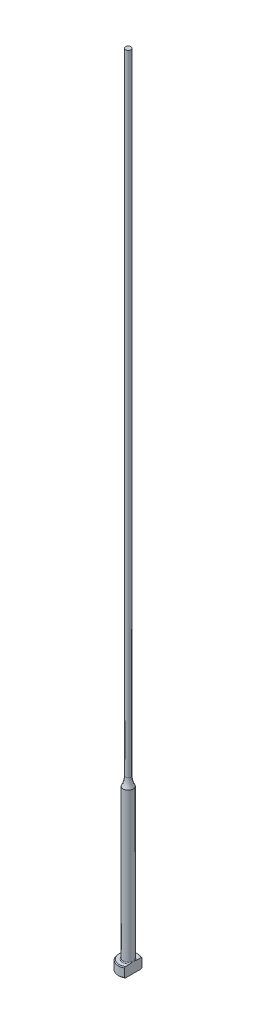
ISO-10303-21;
HEADER;
FILE_DESCRIPTION(('STEP AP214'),'2;1');
FILE_NAME('part.step','',(''),(''),'','','');
FILE_SCHEMA(('AUTOMOTIVE_DESIGN { 1 0 10303 214 1 1 1 1 }'));
ENDSEC;
DATA;
#1=APPLICATION_CONTEXT('core data for automotive mechanical design processes');
#2=APPLICATION_PROTOCOL_DEFINITION('international standard','automotive_design',2000,#1);
#3=PRODUCT_CONTEXT('',#1,'mechanical');
#4=PRODUCT('Part','Part','',(#3));
#5=PRODUCT_RELATED_PRODUCT_CATEGORY('part','',(#4));
#6=PRODUCT_DEFINITION_FORMATION('','',#4);
#7=PRODUCT_DEFINITION_CONTEXT('part definition',#1,'design');
#8=PRODUCT_DEFINITION('design','',#6,#7);
#9=PRODUCT_DEFINITION_SHAPE('','',#8);
#10=(LENGTH_UNIT() NAMED_UNIT(*) SI_UNIT(.MILLI.,.METRE.));
#11=(NAMED_UNIT(*) PLANE_ANGLE_UNIT() SI_UNIT($,.RADIAN.));
#12=(NAMED_UNIT(*) SI_UNIT($,.STERADIAN.) SOLID_ANGLE_UNIT());
#13=UNCERTAINTY_MEASURE_WITH_UNIT(LENGTH_MEASURE(1.E-05),#10,'distance_accuracy_value','');
#14=(GEOMETRIC_REPRESENTATION_CONTEXT(3) GLOBAL_UNCERTAINTY_ASSIGNED_CONTEXT((#13)) GLOBAL_UNIT_ASSIGNED_CONTEXT((#10,
#11,#12)) REPRESENTATION_CONTEXT('',''));
#15=CARTESIAN_POINT('',(0.,0.,0.));
#16=DIRECTION('',(0.,0.,1.));
#17=DIRECTION('',(1.,0.,0.));
#18=AXIS2_PLACEMENT_3D('',#15,#16,#17);
#19=CARTESIAN_POINT('',(-3.17499999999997,3.175,0.));
#20=DIRECTION('',(0.,1.,0.));
#21=DIRECTION('',(0.,0.,1.));
#22=AXIS2_PLACEMENT_3D('',#19,#20,#21);
#23=PLANE('',#22);
#24=CARTESIAN_POINT('',(0.,3.175,0.));
#25=DIRECTION('',(0.,1.,0.));
#26=DIRECTION('',(0.,0.,1.));
#27=AXIS2_PLACEMENT_3D('',#24,#25,#26);
#28=CIRCLE('',#27,2.92099999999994);
#29=CARTESIAN_POINT('',(1.58749999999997,3.175,-2.45195529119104));
#30=VERTEX_POINT('',#29);
#31=CARTESIAN_POINT('',(1.58749999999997,3.175,2.45195529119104));
#32=VERTEX_POINT('',#31);
#33=EDGE_CURVE('E105',#30,#32,#28,.T.);
#34=ORIENTED_EDGE('',*,*,#33,.T.);
#35=DIRECTION('',(0.,0.,1.));
#36=VECTOR('',#35,1.);
#37=CARTESIAN_POINT('',(1.58749999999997,3.17499999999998,2.74963065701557));
#38=LINE('',#37,#36);
#39=CARTESIAN_POINT('',(1.58749999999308,3.175,0.933255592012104));
#40=VERTEX_POINT('',#39);
#41=EDGE_CURVE('E126',#40,#32,#38,.T.);
#42=ORIENTED_EDGE('',*,*,#41,.F.);
#43=CARTESIAN_POINT('',(0.,3.175,0.));
#44=DIRECTION('',(0.,1.,0.));
#45=DIRECTION('',(0.,0.,1.));
#46=AXIS2_PLACEMENT_3D('',#43,#44,#45);
#47=CIRCLE('',#46,1.84149999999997);
#48=CARTESIAN_POINT('',(1.58749999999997,3.17500000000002,-0.933255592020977));
#49=VERTEX_POINT('',#48);
#50=EDGE_CURVE('E11',#40,#49,#47,.F.);
#51=ORIENTED_EDGE('',*,*,#50,.T.);
#52=EDGE_CURVE('E52',#30,#49,#38,.T.);
#53=ORIENTED_EDGE('',*,*,#52,.F.);
#54=EDGE_LOOP('',(#34,#42,#51,#53));
#55=FACE_BOUND('',#54,.T.);
#56=ADVANCED_FACE('F32',(#55),#23,.T.);
#57=CARTESIAN_POINT('',(0.,259.958771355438,0.));
#58=DIRECTION('',(0.,1.,0.));
#59=DIRECTION('',(0.,0.,1.));
#60=AXIS2_PLACEMENT_3D('',#57,#58,#59);
#61=CYLINDRICAL_SURFACE('',#60,3.17499999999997);
#62=CARTESIAN_POINT('',(0.,2.92100000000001,0.));
#63=DIRECTION('',(0.,1.,0.));
#64=DIRECTION('',(0.,0.,1.));
#65=AXIS2_PLACEMENT_3D('',#62,#63,#64);
#66=CIRCLE('',#65,3.17499999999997);
#67=CARTESIAN_POINT('',(1.58749999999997,2.92100000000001,2.74963065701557));
#68=VERTEX_POINT('',#67);
#69=CARTESIAN_POINT('',(1.58749999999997,2.92100000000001,-2.74963065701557));
#70=VERTEX_POINT('',#69);
#71=EDGE_CURVE('E98',#68,#70,#66,.F.);
#72=ORIENTED_EDGE('',*,*,#71,.T.);
#73=DIRECTION('',(0.,-1.,0.));
#74=VECTOR('',#73,1.);
#75=CARTESIAN_POINT('',(1.58749999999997,254.001,-2.74963065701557));
#76=LINE('',#75,#74);
#77=CARTESIAN_POINT('',(1.58749999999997,0.253999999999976,-2.74963065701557));
#78=VERTEX_POINT('',#77);
#79=EDGE_CURVE('E141',#70,#78,#76,.T.);
#80=ORIENTED_EDGE('',*,*,#79,.T.);
#81=CARTESIAN_POINT('',(0.,0.253999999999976,0.));
#82=DIRECTION('',(0.,-1.,0.));
#83=DIRECTION('',(0.,0.,-1.));
#84=AXIS2_PLACEMENT_3D('',#81,#82,#83);
#85=CIRCLE('',#84,3.17499999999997);
#86=CARTESIAN_POINT('',(1.58749999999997,0.253999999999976,2.74963065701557));
#87=VERTEX_POINT('',#86);
#88=EDGE_CURVE('E95',#78,#87,#85,.F.);
#89=ORIENTED_EDGE('',*,*,#88,.T.);
#90=DIRECTION('',(0.,-1.,0.));
#91=VECTOR('',#90,1.);
#92=CARTESIAN_POINT('',(1.58749999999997,254.001,2.74963065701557));
#93=LINE('',#92,#91);
#94=EDGE_CURVE('E88',#68,#87,#93,.T.);
#95=ORIENTED_EDGE('',*,*,#94,.F.);
#96=EDGE_LOOP('',(#72,#80,#89,#95));
#97=FACE_BOUND('',#96,.T.);
#98=ADVANCED_FACE('F191',(#97),#61,.T.);
#99=CARTESIAN_POINT('',(0.,0.,0.));
#100=DIRECTION('',(0.,-1.,0.));
#101=DIRECTION('',(0.,0.,-1.));
#102=AXIS2_PLACEMENT_3D('',#99,#100,#101);
#103=PLANE('',#102);
#104=CARTESIAN_POINT('',(0.,0.,0.));
#105=DIRECTION('',(0.,-1.,0.));
#106=DIRECTION('',(0.,0.,-1.));
#107=AXIS2_PLACEMENT_3D('',#104,#105,#106);
#108=CIRCLE('',#107,2.92100000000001);
#109=CARTESIAN_POINT('',(1.58749999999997,0.,2.45195529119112));
#110=VERTEX_POINT('',#109);
#111=CARTESIAN_POINT('',(1.58749999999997,0.,-2.45195529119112));
#112=VERTEX_POINT('',#111);
#113=EDGE_CURVE('E93',#110,#112,#108,.T.);
#114=ORIENTED_EDGE('',*,*,#113,.T.);
#115=DIRECTION('',(0.,0.,1.));
#116=VECTOR('',#115,1.);
#117=CARTESIAN_POINT('',(1.58749999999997,0.,2.74963065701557));
#118=LINE('',#117,#116);
#119=EDGE_CURVE('E78',#112,#110,#118,.T.);
#120=ORIENTED_EDGE('',*,*,#119,.T.);
#121=EDGE_LOOP('',(#114,#120));
#122=FACE_BOUND('',#121,.T.);
#123=ADVANCED_FACE('F97',(#122),#103,.T.);
#124=CARTESIAN_POINT('',(0.,3.17499999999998,0.));
#125=DIRECTION('',(0.,-1.,0.));
#126=DIRECTION('',(0.,0.,-1.));
#127=AXIS2_PLACEMENT_3D('',#124,#125,#126);
#128=CONICAL_SURFACE('',#127,2.92099999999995,0.785398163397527);
#129=ORIENTED_EDGE('',*,*,#71,.F.);
#130=CARTESIAN_POINT('',(1.58749999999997,-0.16162066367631,-6.0529050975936));
#131=CARTESIAN_POINT('',(1.58749999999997,-0.0288893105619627,-5.91567682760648));
#132=CARTESIAN_POINT('',(1.58749999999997,0.103699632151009,-5.7783103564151));
#133=CARTESIAN_POINT('',(1.58749999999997,0.368508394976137,-5.50321874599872));
#134=CARTESIAN_POINT('',(1.58749999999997,0.500728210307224,-5.36549360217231));
#135=CARTESIAN_POINT('',(1.58749999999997,0.764778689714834,-5.08953516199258));
#136=CARTESIAN_POINT('',(1.58749999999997,0.896609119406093,-4.9513016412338));
#137=CARTESIAN_POINT('',(1.58749999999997,1.15968706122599,-4.67428233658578));
#138=CARTESIAN_POINT('',(1.58749999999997,1.29093457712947,-4.53549655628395));
#139=CARTESIAN_POINT('',(1.58749999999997,1.55007705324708,-4.25997724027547));
#140=CARTESIAN_POINT('',(1.58749999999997,1.67798684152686,-4.12325766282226));
#141=CARTESIAN_POINT('',(1.58749999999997,1.9328486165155,-3.84892898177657));
#142=CARTESIAN_POINT('',(1.58749999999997,2.05980060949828,-3.71131988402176));
#143=CARTESIAN_POINT('',(1.58749999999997,2.31237508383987,-3.43493978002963));
#144=CARTESIAN_POINT('',(1.58749999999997,2.43799784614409,-3.29616903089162));
#145=CARTESIAN_POINT('',(1.58749999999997,2.68741369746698,-3.01699558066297));
#146=CARTESIAN_POINT('',(1.58749999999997,2.81120686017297,-2.8765929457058));
#147=CARTESIAN_POINT('',(1.58749999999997,3.00875865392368,-2.64816703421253));
#148=CARTESIAN_POINT('',(1.58749999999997,3.08336151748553,-2.56087478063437));
#149=CARTESIAN_POINT('',(1.58749999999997,3.2312387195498,-2.38515423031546));
#150=CARTESIAN_POINT('',(1.58749999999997,3.30451292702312,-2.29672582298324));
#151=CARTESIAN_POINT('',(1.58749999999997,3.45004422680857,-2.1174740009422));
#152=CARTESIAN_POINT('',(1.58749999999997,3.5222823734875,-2.02663514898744));
#153=CARTESIAN_POINT('',(1.58749999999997,3.66423097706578,-1.8430252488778));
#154=CARTESIAN_POINT('',(1.58749999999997,3.73394203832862,-1.75025467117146));
#155=CARTESIAN_POINT('',(1.58749999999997,3.87080633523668,-1.5606747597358));
#156=CARTESIAN_POINT('',(1.58749999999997,3.93790459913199,-1.46382547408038));
#157=CARTESIAN_POINT('',(1.58749999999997,4.06669147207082,-1.26632594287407));
#158=CARTESIAN_POINT('',(1.58749999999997,4.1283726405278,-1.16567073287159));
#159=CARTESIAN_POINT('',(1.58749999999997,4.21402252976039,-1.01165766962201));
#160=CARTESIAN_POINT('',(1.58749999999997,4.24127929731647,-0.960142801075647));
#161=CARTESIAN_POINT('',(1.58749999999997,4.2930979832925,-0.855780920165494));
#162=CARTESIAN_POINT('',(1.58749999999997,4.31765941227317,-0.802933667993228));
#163=CARTESIAN_POINT('',(1.58749999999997,4.38614656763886,-0.642461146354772));
#164=CARTESIAN_POINT('',(1.58749999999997,4.42510149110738,-0.532518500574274));
#165=CARTESIAN_POINT('',(1.58749999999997,4.46726244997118,-0.367680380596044));
#166=CARTESIAN_POINT('',(1.58749999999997,4.47844427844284,-0.314802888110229));
#167=CARTESIAN_POINT('',(1.58749999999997,4.49576654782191,-0.208209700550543));
#168=CARTESIAN_POINT('',(1.58749999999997,4.50190743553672,-0.154494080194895));
#169=CARTESIAN_POINT('',(1.58749999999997,4.50871296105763,-0.0468792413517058));
#170=CARTESIAN_POINT('',(1.58749999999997,4.5093945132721,0.00701889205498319));
#171=CARTESIAN_POINT('',(1.58749999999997,4.50527679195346,0.114606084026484));
#172=CARTESIAN_POINT('',(1.58749999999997,4.50047706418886,0.168295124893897));
#173=CARTESIAN_POINT('',(1.58749999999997,4.48579689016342,0.27448544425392));
#174=CARTESIAN_POINT('',(1.58749999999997,4.47596081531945,0.32699298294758));
#175=CARTESIAN_POINT('',(1.58749999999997,4.45181809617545,0.430974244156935));
#176=CARTESIAN_POINT('',(1.58749999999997,4.4375096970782,0.482447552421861));
#177=CARTESIAN_POINT('',(1.58749999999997,4.40502489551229,0.584460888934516));
#178=CARTESIAN_POINT('',(1.58749999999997,4.386827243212,0.634994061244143));
#179=CARTESIAN_POINT('',(1.58749999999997,4.34729308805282,0.734789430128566));
#180=CARTESIAN_POINT('',(1.58749999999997,4.3259572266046,0.784051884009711));
#181=CARTESIAN_POINT('',(1.58749999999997,4.25791922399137,0.930549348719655));
#182=CARTESIAN_POINT('',(1.58749999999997,4.20736047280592,1.0259880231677));
#183=CARTESIAN_POINT('',(1.58749999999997,4.0995545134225,1.21304313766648));
#184=CARTESIAN_POINT('',(1.58749999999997,4.04229912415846,1.30465471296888));
#185=CARTESIAN_POINT('',(1.58749999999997,3.92308746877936,1.48526211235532));
#186=CARTESIAN_POINT('',(1.58749999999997,3.86111349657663,1.57424615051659));
#187=CARTESIAN_POINT('',(1.58749999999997,3.73408621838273,1.74990003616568));
#188=CARTESIAN_POINT('',(1.58749999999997,3.66903444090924,1.83657099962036));
#189=CARTESIAN_POINT('',(1.58749999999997,3.53583371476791,2.00931764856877));
#190=CARTESIAN_POINT('',(1.58749999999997,3.46765527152,2.09537048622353));
#191=CARTESIAN_POINT('',(1.58749999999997,3.32960643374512,2.26611736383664));
#192=CARTESIAN_POINT('',(1.58749999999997,3.25973586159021,2.35081125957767));
#193=CARTESIAN_POINT('',(1.58749999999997,3.04858139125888,2.60290121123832));
#194=CARTESIAN_POINT('',(1.58749999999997,2.90542388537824,2.76872537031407));
#195=CARTESIAN_POINT('',(1.58749999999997,2.64069522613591,3.06970913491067));
#196=CARTESIAN_POINT('',(1.58749999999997,2.51959458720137,3.20528660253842));
#197=CARTESIAN_POINT('',(1.58749999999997,2.27590400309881,3.47510321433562));
#198=CARTESIAN_POINT('',(1.58749999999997,2.15331401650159,3.60934232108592));
#199=CARTESIAN_POINT('',(1.58749999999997,1.90694239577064,3.87695374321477));
#200=CARTESIAN_POINT('',(1.58749999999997,1.78315974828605,4.0103251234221));
#201=CARTESIAN_POINT('',(1.58749999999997,1.53478104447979,4.27630880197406));
#202=CARTESIAN_POINT('',(1.58749999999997,1.41018498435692,4.40892109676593));
#203=CARTESIAN_POINT('',(1.58749999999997,1.0457468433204,4.79499418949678));
#204=CARTESIAN_POINT('',(1.58749999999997,0.80507680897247,5.04767313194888));
#205=CARTESIAN_POINT('',(1.58749999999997,0.443121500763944,5.42550911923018));
#206=CARTESIAN_POINT('',(1.58749999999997,0.322378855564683,5.55118772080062));
#207=CARTESIAN_POINT('',(1.58749999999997,0.0805914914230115,5.80225207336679));
#208=CARTESIAN_POINT('',(1.58749999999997,-0.040453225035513,5.92763782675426));
#209=CARTESIAN_POINT('',(1.58749999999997,-0.161620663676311,6.0529050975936));
#210=B_SPLINE_CURVE_WITH_KNOTS('',3,(#130,#131,#132,#133,#134,#135,#136,#137,#138,#139,#140,
#141,#142,#143,#144,#145,#146,#147,#148,#149,#150,#151,#152,#153,#154,#155,#156,#157,#158,#159,
#160,#161,#162,#163,#164,#165,#166,#167,#168,#169,#170,#171,#172,#173,#174,#175,#176,#177,#178,
#179,#180,#181,#182,#183,#184,#185,#186,#187,#188,#189,#190,#191,#192,#193,#194,#195,#196,#197,
#198,#199,#200,#201,#202,#203,#204,#205,#206,#207,#208,#209),.UNSPECIFIED.,.F.,.F.,(4,2,2,2,2,2,
2,2,2,2,2,2,2,2,2,2,2,2,2,2,2,2,2,2,2,2,2,2,2,2,2,2,2,2,2,2,2,2,2,4),(0.,0.572750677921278,
1.14550874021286,1.71856057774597,2.29160869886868,2.85328006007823,3.4149477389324,
3.97649423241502,4.53801804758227,4.88249307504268,5.22700189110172,5.5751532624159,
5.92322081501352,6.27657800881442,6.63041319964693,6.80518126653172,6.9799810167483,
7.3282426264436,7.49018491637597,7.65211285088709,7.81353889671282,7.97497832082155,
8.13501929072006,8.29512313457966,8.45612518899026,8.61709438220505,8.94062993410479,
9.2645649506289,9.58978187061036,9.91483894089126,10.2441741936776,10.5735441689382,
11.2306812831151,11.7760337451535,12.3214014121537,12.8672825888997,13.4131663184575,
14.4600164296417,14.9828595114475,15.5056983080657),.UNSPECIFIED.);
#211=EDGE_CURVE('E118',#32,#68,#210,.T.);
#212=ORIENTED_EDGE('',*,*,#211,.F.);
#213=ORIENTED_EDGE('',*,*,#33,.F.);
#214=EDGE_CURVE('E117',#70,#30,#210,.T.);
#215=ORIENTED_EDGE('',*,*,#214,.F.);
#216=EDGE_LOOP('',(#129,#212,#213,#215));
#217=FACE_BOUND('',#216,.T.);
#218=ADVANCED_FACE('F162',(#217),#128,.T.);
#219=CARTESIAN_POINT('',(0.,0.253999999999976,0.));
#220=DIRECTION('',(0.,1.,0.));
#221=DIRECTION('',(0.,0.,1.));
#222=AXIS2_PLACEMENT_3D('',#219,#220,#221);
#223=CONICAL_SURFACE('',#222,3.17499999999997,0.785398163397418);
#224=ORIENTED_EDGE('',*,*,#88,.F.);
#225=CARTESIAN_POINT('',(1.58749999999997,3.33662066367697,6.0529050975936));
#226=CARTESIAN_POINT('',(1.58749999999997,3.20388931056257,5.91567682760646));
#227=CARTESIAN_POINT('',(1.58749999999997,3.07130036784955,5.77831035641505));
#228=CARTESIAN_POINT('',(1.58749999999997,2.80649160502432,5.50321874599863));
#229=CARTESIAN_POINT('',(1.58749999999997,2.67427178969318,5.3654936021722));
#230=CARTESIAN_POINT('',(1.58749999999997,2.41022131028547,5.08953516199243));
#231=CARTESIAN_POINT('',(1.58749999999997,2.27839088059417,4.95130164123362));
#232=CARTESIAN_POINT('',(1.58749999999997,2.01531293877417,4.67428233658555));
#233=CARTESIAN_POINT('',(1.58749999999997,1.88406542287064,4.5354965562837));
#234=CARTESIAN_POINT('',(1.58749999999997,1.62492294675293,4.25997724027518));
#235=CARTESIAN_POINT('',(1.58749999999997,1.49701315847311,4.12325766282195));
#236=CARTESIAN_POINT('',(1.58749999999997,1.24215138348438,3.84892898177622));
#237=CARTESIAN_POINT('',(1.58749999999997,1.11519939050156,3.71131988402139));
#238=CARTESIAN_POINT('',(1.58749999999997,0.862624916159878,3.43493978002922));
#239=CARTESIAN_POINT('',(1.58749999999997,0.737002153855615,3.29616903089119));
#240=CARTESIAN_POINT('',(1.58749999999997,0.487586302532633,3.01699558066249));
#241=CARTESIAN_POINT('',(1.58749999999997,0.363793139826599,2.8765929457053));
#242=CARTESIAN_POINT('',(1.58749999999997,0.166241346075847,2.64816703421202));
#243=CARTESIAN_POINT('',(1.58749999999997,0.0916384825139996,2.56087478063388));
#244=CARTESIAN_POINT('',(1.58749999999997,-0.0562387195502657,2.385154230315));
#245=CARTESIAN_POINT('',(1.58749999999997,-0.129512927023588,2.29672582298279));
#246=CARTESIAN_POINT('',(1.58749999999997,-0.27504422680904,2.11747400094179));
#247=CARTESIAN_POINT('',(1.58749999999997,-0.347282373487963,2.02663514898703));
#248=CARTESIAN_POINT('',(1.58749999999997,-0.489230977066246,1.84302524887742));
#249=CARTESIAN_POINT('',(1.58749999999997,-0.558942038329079,1.7502546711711));
#250=CARTESIAN_POINT('',(1.58749999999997,-0.695806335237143,1.56067475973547));
#251=CARTESIAN_POINT('',(1.58749999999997,-0.762904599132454,1.46382547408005));
#252=CARTESIAN_POINT('',(1.58749999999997,-0.891691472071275,1.26632594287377));
#253=CARTESIAN_POINT('',(1.58749999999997,-0.953372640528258,1.16567073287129));
#254=CARTESIAN_POINT('',(1.58749999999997,-1.03902252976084,1.01165766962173));
#255=CARTESIAN_POINT('',(1.58749999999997,-1.06627929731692,0.960142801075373));
#256=CARTESIAN_POINT('',(1.58749999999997,-1.11809798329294,0.85578092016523));
#257=CARTESIAN_POINT('',(1.58749999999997,-1.14265941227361,0.802933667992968));
#258=CARTESIAN_POINT('',(1.58749999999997,-1.21114656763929,0.642461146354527));
#259=CARTESIAN_POINT('',(1.58749999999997,-1.2501014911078,0.532518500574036));
#260=CARTESIAN_POINT('',(1.58749999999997,-1.29226244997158,0.367680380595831));
#261=CARTESIAN_POINT('',(1.58749999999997,-1.30344427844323,0.314802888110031));
#262=CARTESIAN_POINT('',(1.58749999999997,-1.32076654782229,0.208209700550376));
#263=CARTESIAN_POINT('',(1.58749999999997,-1.3269074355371,0.154494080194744));
#264=CARTESIAN_POINT('',(1.58749999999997,-1.333712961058,0.0468792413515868));
#265=CARTESIAN_POINT('',(1.58749999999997,-1.33439451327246,-0.00701889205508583));
#266=CARTESIAN_POINT('',(1.58749999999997,-1.33027679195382,-0.114606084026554));
#267=CARTESIAN_POINT('',(1.58749999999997,-1.32547706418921,-0.168295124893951));
#268=CARTESIAN_POINT('',(1.58749999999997,-1.31079689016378,-0.274485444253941));
#269=CARTESIAN_POINT('',(1.58749999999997,-1.3009608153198,-0.326992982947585));
#270=CARTESIAN_POINT('',(1.58749999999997,-1.27681809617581,-0.430974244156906));
#271=CARTESIAN_POINT('',(1.58749999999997,-1.26250969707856,-0.482447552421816));
#272=CARTESIAN_POINT('',(1.58749999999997,-1.23002489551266,-0.584460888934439));
#273=CARTESIAN_POINT('',(1.58749999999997,-1.21182724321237,-0.634994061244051));
#274=CARTESIAN_POINT('',(1.58749999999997,-1.1722930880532,-0.734789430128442));
#275=CARTESIAN_POINT('',(1.58749999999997,-1.15095722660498,-0.784051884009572));
#276=CARTESIAN_POINT('',(1.58749999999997,-1.08291922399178,-0.93054934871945));
#277=CARTESIAN_POINT('',(1.58749999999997,-1.03236047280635,-1.02598802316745));
#278=CARTESIAN_POINT('',(1.58749999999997,-0.924554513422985,-1.21304313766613));
#279=CARTESIAN_POINT('',(1.58749999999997,-0.86729912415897,-1.30465471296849));
#280=CARTESIAN_POINT('',(1.58749999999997,-0.748087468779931,-1.48526211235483));
#281=CARTESIAN_POINT('',(1.58749999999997,-0.686113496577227,-1.57424615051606));
#282=CARTESIAN_POINT('',(1.58749999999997,-0.55908621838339,-1.74990003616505));
#283=CARTESIAN_POINT('',(1.58749999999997,-0.494034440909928,-1.83657099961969));
#284=CARTESIAN_POINT('',(1.58749999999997,-0.360833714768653,-2.00931764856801));
#285=CARTESIAN_POINT('',(1.58749999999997,-0.292655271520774,-2.09537048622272));
#286=CARTESIAN_POINT('',(1.58749999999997,-0.154606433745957,-2.26611736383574));
#287=CARTESIAN_POINT('',(1.58749999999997,-0.0847358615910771,-2.35081125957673));
#288=CARTESIAN_POINT('',(1.58749999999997,0.126418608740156,-2.60290121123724));
#289=CARTESIAN_POINT('',(1.58749999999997,0.269576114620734,-2.76872537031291));
#290=CARTESIAN_POINT('',(1.58749999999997,0.534304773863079,-3.06970913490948));
#291=CARTESIAN_POINT('',(1.58749999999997,0.655405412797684,-3.20528660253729));
#292=CARTESIAN_POINT('',(1.58749999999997,0.899095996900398,-3.47510321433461));
#293=CARTESIAN_POINT('',(1.58749999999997,1.02168598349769,-3.60934232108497));
#294=CARTESIAN_POINT('',(1.58749999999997,1.26805760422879,-3.87695374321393));
#295=CARTESIAN_POINT('',(1.58749999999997,1.39184025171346,-4.01032512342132));
#296=CARTESIAN_POINT('',(1.58749999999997,1.64021895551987,-4.2763088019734));
#297=CARTESIAN_POINT('',(1.58749999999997,1.76481501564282,-4.40892109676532));
#298=CARTESIAN_POINT('',(1.58749999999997,2.12925315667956,-4.79499418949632));
#299=CARTESIAN_POINT('',(1.58749999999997,2.36992319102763,-5.04767313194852));
#300=CARTESIAN_POINT('',(1.58749999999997,2.73187849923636,-5.42550911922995));
#301=CARTESIAN_POINT('',(1.58749999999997,2.85262114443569,-5.55118772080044));
#302=CARTESIAN_POINT('',(1.58749999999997,3.09440850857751,-5.8022520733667));
#303=CARTESIAN_POINT('',(1.58749999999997,3.2154532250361,-5.92763782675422));
#304=CARTESIAN_POINT('',(1.58749999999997,3.33662066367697,-6.0529050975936));
#305=B_SPLINE_CURVE_WITH_KNOTS('',3,(#225,#226,#227,#228,#229,#230,#231,#232,#233,#234,#235,
#236,#237,#238,#239,#240,#241,#242,#243,#244,#245,#246,#247,#248,#249,#250,#251,#252,#253,#254,
#255,#256,#257,#258,#259,#260,#261,#262,#263,#264,#265,#266,#267,#268,#269,#270,#271,#272,#273,
#274,#275,#276,#277,#278,#279,#280,#281,#282,#283,#284,#285,#286,#287,#288,#289,#290,#291,#292,
#293,#294,#295,#296,#297,#298,#299,#300,#301,#302,#303,#304),.UNSPECIFIED.,.F.,.F.,(4,2,2,2,2,2,
2,2,2,2,2,2,2,2,2,2,2,2,2,2,2,2,2,2,2,2,2,2,2,2,2,2,2,2,2,2,2,2,2,4),(0.,0.57275067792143,
1.14550874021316,1.71856057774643,2.29160869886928,2.85328006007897,3.41494773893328,
3.97649423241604,4.53801804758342,4.88249307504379,5.2270018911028,5.57515326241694,
5.92322081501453,6.27657800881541,6.63041319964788,6.80518126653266,6.97998101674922,
7.32824262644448,7.49018491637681,7.65211285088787,7.81353889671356,7.97497832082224,
8.1350192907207,8.29512313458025,8.45612518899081,8.61709438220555,8.94062993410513,
9.26456495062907,9.58978187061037,9.91483894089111,10.2441741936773,10.5735441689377,
11.2306812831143,11.776033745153,12.3214014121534,12.8672825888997,13.4131663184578,
14.4600164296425,14.9828595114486,15.505698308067),.UNSPECIFIED.);
#306=EDGE_CURVE('E81',#112,#78,#305,.T.);
#307=ORIENTED_EDGE('',*,*,#306,.F.);
#308=ORIENTED_EDGE('',*,*,#113,.F.);
#309=EDGE_CURVE('E84',#87,#110,#305,.T.);
#310=ORIENTED_EDGE('',*,*,#309,.F.);
#311=EDGE_LOOP('',(#224,#307,#308,#310));
#312=FACE_BOUND('',#311,.T.);
#313=ADVANCED_FACE('F92',(#312),#223,.T.);
#314=CARTESIAN_POINT('',(0.,3.42900000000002,0.));
#315=DIRECTION('',(0.,1.,0.));
#316=DIRECTION('',(0.,0.,1.));
#317=AXIS2_PLACEMENT_3D('',#314,#315,#316);
#318=TOROIDAL_SURFACE('',#317,1.84149999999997,0.254);
#319=CARTESIAN_POINT('',(1.58749999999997,3.42900000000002,0.));
#320=CARTESIAN_POINT('',(1.58749999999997,3.42899942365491,-1.9220514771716E-10));
#321=CARTESIAN_POINT('',(1.58749999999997,3.42899884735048,-1.2261161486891E-07));
#322=CARTESIAN_POINT('',(1.58749999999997,3.42899773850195,-5.09676365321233E-07));
#323=CARTESIAN_POINT('',(1.58749999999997,3.42899720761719,-7.78176328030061E-07));
#324=CARTESIAN_POINT('',(1.58749999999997,3.42899614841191,-1.42307272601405E-06));
#325=CARTESIAN_POINT('',(1.58749999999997,3.42899562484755,-1.80713867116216E-06));
#326=CARTESIAN_POINT('',(1.58749999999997,3.42899463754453,-2.63494846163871E-06));
#327=CARTESIAN_POINT('',(1.58749999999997,3.42899417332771,-3.07814756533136E-06));
#328=CARTESIAN_POINT('',(1.58749999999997,3.42899261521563,-4.66897357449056E-06));
#329=CARTESIAN_POINT('',(1.58749999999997,3.42899159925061,-5.89404908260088E-06));
#330=CARTESIAN_POINT('',(1.58749999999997,3.42898979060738,-8.42427511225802E-06));
#331=CARTESIAN_POINT('',(1.58749999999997,3.42898899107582,-9.7248057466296E-06));
#332=CARTESIAN_POINT('',(1.58749999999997,3.42898598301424,-1.48060601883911E-05));
#333=CARTESIAN_POINT('',(1.58749999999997,3.42898393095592,-1.86838281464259E-05));
#334=CARTESIAN_POINT('',(1.58749999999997,3.42898057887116,-2.63261117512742E-05));
#335=CARTESIAN_POINT('',(1.58749999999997,3.42897922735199,-3.00687417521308E-05));
#336=CARTESIAN_POINT('',(1.58749999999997,3.42897347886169,-4.60276298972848E-05));
#337=CARTESIAN_POINT('',(1.58749999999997,3.42896911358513,-5.8247019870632E-05));
#338=CARTESIAN_POINT('',(1.58749999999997,3.42896211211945,-8.11070097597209E-05));
#339=CARTESIAN_POINT('',(1.58749999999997,3.42895931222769,-9.16953114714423E-05));
#340=CARTESIAN_POINT('',(1.58749999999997,3.42893712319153,-0.000168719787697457));
#341=CARTESIAN_POINT('',(1.58749999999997,3.42890881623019,-0.000232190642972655));
#342=CARTESIAN_POINT('',(1.58749999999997,3.42880276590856,-0.000479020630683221));
#343=CARTESIAN_POINT('',(1.58749999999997,3.42873165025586,-0.00066443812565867));
#344=CARTESIAN_POINT('',(1.58749999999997,3.42845137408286,-0.0013844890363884));
#345=CARTESIAN_POINT('',(1.58749999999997,3.42823526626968,-0.00191701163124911));
#346=CARTESIAN_POINT('',(1.58749999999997,3.42735449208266,-0.00409774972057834));
#347=CARTESIAN_POINT('',(1.58749999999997,3.42669768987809,-0.00574830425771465));
#348=CARTESIAN_POINT('',(1.58749999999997,3.4174405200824,-0.0289985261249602));
#349=CARTESIAN_POINT('',(1.58749999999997,3.40878325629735,-0.0505816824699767));
#350=CARTESIAN_POINT('',(1.58749999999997,3.39189297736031,-0.0929947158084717));
#351=CARTESIAN_POINT('',(1.58749999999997,3.38365605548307,-0.11382315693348));
#352=CARTESIAN_POINT('',(1.58749999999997,3.36635393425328,-0.157956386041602));
#353=CARTESIAN_POINT('',(1.58749999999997,3.35730391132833,-0.181267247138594));
#354=CARTESIAN_POINT('',(1.58749999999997,3.33936775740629,-0.228222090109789));
#355=CARTESIAN_POINT('',(1.58749999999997,3.33048420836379,-0.25186705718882));
#356=CARTESIAN_POINT('',(1.58749999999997,3.30894496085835,-0.310512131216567));
#357=CARTESIAN_POINT('',(1.58749999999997,3.29649449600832,-0.345588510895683));
#358=CARTESIAN_POINT('',(1.58749999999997,3.27296975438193,-0.415278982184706));
#359=CARTESIAN_POINT('',(1.58749999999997,3.26186987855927,-0.449884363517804));
#360=CARTESIAN_POINT('',(1.58749999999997,3.2395832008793,-0.524471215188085));
#361=CARTESIAN_POINT('',(1.58749999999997,3.22860862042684,-0.564517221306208));
#362=CARTESIAN_POINT('',(1.58749999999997,3.20902534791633,-0.645529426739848));
#363=CARTESIAN_POINT('',(1.58749999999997,3.20043582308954,-0.686500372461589));
#364=CARTESIAN_POINT('',(1.58749999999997,3.18611712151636,-0.771546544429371));
#365=CARTESIAN_POINT('',(1.58749999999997,3.18059550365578,-0.815658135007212));
#366=CARTESIAN_POINT('',(1.58749999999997,3.17455396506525,-0.904117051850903));
#367=CARTESIAN_POINT('',(1.58749999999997,3.17401361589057,-0.948462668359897));
#368=CARTESIAN_POINT('',(1.58749999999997,3.17898948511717,-1.02531896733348));
#369=CARTESIAN_POINT('',(1.58749999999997,3.1829739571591,-1.05792141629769));
#370=CARTESIAN_POINT('',(1.58749999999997,3.19569167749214,-1.12184393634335));
#371=CARTESIAN_POINT('',(1.58749999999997,3.20436049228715,-1.1531753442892));
#372=CARTESIAN_POINT('',(1.58749999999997,3.22236152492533,-1.19946468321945));
#373=CARTESIAN_POINT('',(1.58749999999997,3.2295150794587,-1.21526783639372));
#374=CARTESIAN_POINT('',(1.58749999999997,3.24587062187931,-1.24583726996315));
#375=CARTESIAN_POINT('',(1.58749999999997,3.25507530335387,-1.26060215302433));
#376=CARTESIAN_POINT('',(1.58749999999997,3.27378481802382,-1.28575815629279));
#377=CARTESIAN_POINT('',(1.58749999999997,3.28289001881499,-1.29644383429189));
#378=CARTESIAN_POINT('',(1.58749999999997,3.30268460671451,-1.31623154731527));
#379=CARTESIAN_POINT('',(1.58749999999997,3.31337067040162,-1.32533681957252));
#380=CARTESIAN_POINT('',(1.58749999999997,3.33349977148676,-1.33941140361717));
#381=CARTESIAN_POINT('',(1.58749999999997,3.34261446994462,-1.34484814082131));
#382=CARTESIAN_POINT('',(1.58749999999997,3.36161455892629,-1.35416329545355));
#383=CARTESIAN_POINT('',(1.58749999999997,3.37149946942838,-1.35804267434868));
#384=CARTESIAN_POINT('',(1.58749999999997,3.39188678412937,-1.36398436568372));
#385=CARTESIAN_POINT('',(1.58749999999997,3.40239309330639,-1.36603350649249));
#386=CARTESIAN_POINT('',(1.58749999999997,3.42360372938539,-1.3680840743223));
#387=CARTESIAN_POINT('',(1.58749999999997,3.43430795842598,-1.36808648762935));
#388=CARTESIAN_POINT('',(1.58749999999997,3.45433283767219,-1.36616208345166));
#389=CARTESIAN_POINT('',(1.58749999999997,3.46367506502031,-1.36444960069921));
#390=CARTESIAN_POINT('',(1.58749999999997,3.48195519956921,-1.35953338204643));
#391=CARTESIAN_POINT('',(1.58749999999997,3.49089304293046,-1.3563294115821));
#392=CARTESIAN_POINT('',(1.58749999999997,3.50850302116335,-1.34848006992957));
#393=CARTESIAN_POINT('',(1.58749999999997,3.5171531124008,-1.34378578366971));
#394=CARTESIAN_POINT('',(1.58749999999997,3.53371257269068,-1.33324445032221));
#395=CARTESIAN_POINT('',(1.58749999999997,3.54162163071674,-1.32739692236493));
#396=CARTESIAN_POINT('',(1.58749999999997,3.56107121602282,-1.31107304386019));
#397=CARTESIAN_POINT('',(1.58749999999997,3.57202221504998,-1.29989286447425));
#398=CARTESIAN_POINT('',(1.58749999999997,3.59202509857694,-1.27593566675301));
#399=CARTESIAN_POINT('',(1.58749999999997,3.60107086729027,-1.26315370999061));
#400=CARTESIAN_POINT('',(1.58749999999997,3.62186023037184,-1.22930733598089));
#401=CARTESIAN_POINT('',(1.58749999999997,3.63240584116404,-1.20751096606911));
#402=CARTESIAN_POINT('',(1.58749999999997,3.65004643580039,-1.16266144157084));
#403=CARTESIAN_POINT('',(1.58749999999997,3.65714435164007,-1.13960937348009));
#404=CARTESIAN_POINT('',(1.58749999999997,3.67265428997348,-1.07603916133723));
#405=CARTESIAN_POINT('',(1.58749999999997,3.67834921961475,-1.03486686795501));
#406=CARTESIAN_POINT('',(1.58749999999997,3.68382880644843,-0.951558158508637));
#407=CARTESIAN_POINT('',(1.58749999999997,3.68350976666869,-0.909417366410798));
#408=CARTESIAN_POINT('',(1.58749999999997,3.67745397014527,-0.811383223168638));
#409=CARTESIAN_POINT('',(1.58749999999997,3.66993873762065,-0.755610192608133));
#410=CARTESIAN_POINT('',(1.58749999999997,3.64933373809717,-0.644937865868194));
#411=CARTESIAN_POINT('',(1.58749999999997,3.63621897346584,-0.59004364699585));
#412=CARTESIAN_POINT('',(1.58749999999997,3.60740922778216,-0.485757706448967));
#413=CARTESIAN_POINT('',(1.58749999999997,3.59201096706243,-0.436281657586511));
#414=CARTESIAN_POINT('',(1.58749999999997,3.55922497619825,-0.338551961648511));
#415=CARTESIAN_POINT('',(1.58749999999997,3.5418584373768,-0.290291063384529));
#416=CARTESIAN_POINT('',(1.58749999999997,3.51760237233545,-0.225557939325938));
#417=CARTESIAN_POINT('',(1.58749999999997,3.51126413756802,-0.208874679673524));
#418=CARTESIAN_POINT('',(1.58749999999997,3.49830042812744,-0.17512392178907));
#419=CARTESIAN_POINT('',(1.58749999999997,3.49167176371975,-0.158057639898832));
#420=CARTESIAN_POINT('',(1.58749999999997,3.47585523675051,-0.117638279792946));
#421=CARTESIAN_POINT('',(1.58749999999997,3.46662970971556,-0.0943002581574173));
#422=CARTESIAN_POINT('',(1.58749999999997,3.44889695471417,-0.0497824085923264));
#423=CARTESIAN_POINT('',(1.58749999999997,3.44040039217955,-0.028598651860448));
#424=CARTESIAN_POINT('',(1.58749999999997,3.43130364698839,-0.00575168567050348));
#425=CARTESIAN_POINT('',(1.58749999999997,3.43064818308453,-0.00410451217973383));
#426=CARTESIAN_POINT('',(1.58749999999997,3.42976776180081,-0.00192459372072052));
#427=CARTESIAN_POINT('',(1.58749999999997,3.42955062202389,-0.00138952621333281));
#428=CARTESIAN_POINT('',(1.58749999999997,3.42926908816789,-0.000666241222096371));
#429=CARTESIAN_POINT('',(1.58749999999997,3.42919771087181,-0.000480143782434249));
#430=CARTESIAN_POINT('',(1.58749999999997,3.42909131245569,-0.000232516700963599));
#431=CARTESIAN_POINT('',(1.58749999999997,3.42906294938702,-0.000168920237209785));
#432=CARTESIAN_POINT('',(1.58749999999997,3.42904072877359,-9.17527162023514E-05));
#433=CARTESIAN_POINT('',(1.58749999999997,3.42903792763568,-8.11550293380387E-05));
#434=CARTESIAN_POINT('',(1.58749999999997,3.42903091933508,-5.82743948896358E-05));
#435=CARTESIAN_POINT('',(1.58749999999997,3.42902654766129,-4.60440001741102E-05));
#436=CARTESIAN_POINT('',(1.58749999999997,3.42902079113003,-3.00727682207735E-05));
#437=CARTESIAN_POINT('',(1.58749999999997,3.42901943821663,-2.63286807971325E-05));
#438=CARTESIAN_POINT('',(1.58749999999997,3.42901608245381,-1.86836529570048E-05));
#439=CARTESIAN_POINT('',(1.58749999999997,3.4290140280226,-1.48046517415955E-05));
#440=CARTESIAN_POINT('',(1.58749999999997,3.42901101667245,-9.72223943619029E-06));
#441=CARTESIAN_POINT('',(1.58749999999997,3.42901021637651,-8.42159649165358E-06));
#442=CARTESIAN_POINT('',(1.58749999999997,3.42900840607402,-5.89129729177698E-06));
#443=CARTESIAN_POINT('',(1.58749999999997,3.42900738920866,-4.66626867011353E-06));
#444=CARTESIAN_POINT('',(1.58749999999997,3.42900582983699,-3.07568803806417E-06));
#445=CARTESIAN_POINT('',(1.58749999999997,3.42900536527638,-2.63259565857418E-06));
#446=CARTESIAN_POINT('',(1.58749999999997,3.4290043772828,-1.80506085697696E-06));
#447=CARTESIAN_POINT('',(1.58749999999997,3.42900385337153,-1.42116387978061E-06));
#448=CARTESIAN_POINT('',(1.58749999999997,3.42900279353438,-7.76675643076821E-07));
#449=CARTESIAN_POINT('',(1.58749999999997,3.42900226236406,-5.08406487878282E-07));
#450=CARTESIAN_POINT('',(1.58749999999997,3.42900115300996,-1.21901887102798E-07));
#451=CARTESIAN_POINT('',(1.58749999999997,3.42900057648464,1.92251677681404E-10));
#452=CARTESIAN_POINT('',(1.58749999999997,3.42900000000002,0.));
#453=B_SPLINE_CURVE_WITH_KNOTS('',3,(#319,#320,#321,#322,#323,#324,#325,#326,#327,#328,#329,
#330,#331,#332,#333,#334,#335,#336,#337,#338,#339,#340,#341,#342,#343,#344,#345,#346,#347,#348,
#349,#350,#351,#352,#353,#354,#355,#356,#357,#358,#359,#360,#361,#362,#363,#364,#365,#366,#367,
#368,#369,#370,#371,#372,#373,#374,#375,#376,#377,#378,#379,#380,#381,#382,#383,#384,#385,#386,
#387,#388,#389,#390,#391,#392,#393,#394,#395,#396,#397,#398,#399,#400,#401,#402,#403,#404,#405,
#406,#407,#408,#409,#410,#411,#412,#413,#414,#415,#416,#417,#418,#419,#420,#421,#422,#423,#424,
#425,#426,#427,#428,#429,#430,#431,#432,#433,#434,#435,#436,#437,#438,#439,#440,#441,#442,#443,
#444,#445,#446,#447,#448,#449,#450,#451,#452),.UNSPECIFIED.,.T.,.F.,(4,2,2,2,2,2,2,2,2,2,2,2,2,
2,2,2,2,2,2,2,2,2,2,2,2,2,2,2,2,2,2,2,2,2,2,2,2,2,2,2,2,2,2,2,2,2,2,2,2,2,2,2,2,2,2,2,2,2,2,2,2,
2,2,2,2,2,4),(0.,1.72815458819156E-06,3.50429255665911E-06,5.44431004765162E-06,
7.3675525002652E-06,1.2119089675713E-05,1.66953775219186E-05,2.98160400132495E-05,
4.17409564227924E-05,8.0660475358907E-05,0.000113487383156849,0.000321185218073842,
0.000917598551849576,0.00264089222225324,0.00797105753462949,0.0777276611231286,
0.144923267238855,0.219939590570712,0.295714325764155,0.407362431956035,0.516367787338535,
0.640878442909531,0.766362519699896,0.899536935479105,1.03216495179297,1.13045740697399,
1.22743103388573,1.27935899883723,1.33135556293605,1.37333248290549,1.41522237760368,
1.44693946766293,1.47863694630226,1.51056074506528,1.54246916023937,1.57083210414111,
1.59919951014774,1.62861579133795,1.65804436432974,1.70472658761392,1.75155645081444,
1.82378709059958,1.89595619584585,2.01995471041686,2.1460932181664,2.31447224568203,
2.48361094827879,2.6389891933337,2.79283011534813,2.84637031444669,2.9012946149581,
2.97658236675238,3.04504771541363,3.05036697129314,3.05209849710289,3.05269709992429,
3.05290520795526,3.05293806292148,3.05297701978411,3.05298895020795,3.05300207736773,
3.05300665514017,3.0530114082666,3.05301333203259,3.05301527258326,3.05301704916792,
3.05301877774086),.UNSPECIFIED.);
#454=CARTESIAN_POINT('',(1.58749999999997,3.42900000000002,0.));
#455=VERTEX_POINT('',#454);
#456=EDGE_CURVE('E47',#455,#49,#453,.T.);
#457=ORIENTED_EDGE('',*,*,#456,.T.);
#458=ORIENTED_EDGE('',*,*,#50,.F.);
#459=CARTESIAN_POINT('',(1.58749999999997,3.42900000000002,0.));
#460=CARTESIAN_POINT('',(1.58749999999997,3.42900057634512,1.9220512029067E-10));
#461=CARTESIAN_POINT('',(1.58749999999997,3.42900115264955,1.22611614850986E-07));
#462=CARTESIAN_POINT('',(1.58749999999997,3.42900226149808,5.09676365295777E-07));
#463=CARTESIAN_POINT('',(1.58749999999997,3.42900279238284,7.78176328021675E-07));
#464=CARTESIAN_POINT('',(1.58749999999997,3.42900385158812,1.42307272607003E-06));
#465=CARTESIAN_POINT('',(1.58749999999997,3.42900437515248,1.80713867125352E-06));
#466=CARTESIAN_POINT('',(1.58749999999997,3.4290053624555,2.63494846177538E-06));
#467=CARTESIAN_POINT('',(1.58749999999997,3.42900582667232,3.0781475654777E-06));
#468=CARTESIAN_POINT('',(1.58749999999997,3.4290073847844,4.66897357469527E-06));
#469=CARTESIAN_POINT('',(1.58749999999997,3.42900840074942,5.89404908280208E-06));
#470=CARTESIAN_POINT('',(1.58749999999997,3.42901020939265,8.42427511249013E-06));
#471=CARTESIAN_POINT('',(1.58749999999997,3.42901100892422,9.72480574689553E-06));
#472=CARTESIAN_POINT('',(1.58749999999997,3.42901401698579,1.48060601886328E-05));
#473=CARTESIAN_POINT('',(1.58749999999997,3.42901606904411,1.86838281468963E-05));
#474=CARTESIAN_POINT('',(1.58749999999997,3.42901942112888,2.63261117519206E-05));
#475=CARTESIAN_POINT('',(1.58749999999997,3.42902077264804,3.00687417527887E-05));
#476=CARTESIAN_POINT('',(1.58749999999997,3.42902652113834,4.60276298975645E-05));
#477=CARTESIAN_POINT('',(1.58749999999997,3.4290308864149,5.82470198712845E-05));
#478=CARTESIAN_POINT('',(1.58749999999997,3.42903788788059,8.11070097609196E-05));
#479=CARTESIAN_POINT('',(1.58749999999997,3.42904068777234,9.16953114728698E-05));
#480=CARTESIAN_POINT('',(1.58749999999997,3.4290628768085,0.000168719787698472));
#481=CARTESIAN_POINT('',(1.58749999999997,3.42909118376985,0.000232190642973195));
#482=CARTESIAN_POINT('',(1.58749999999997,3.42919723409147,0.000479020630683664));
#483=CARTESIAN_POINT('',(1.58749999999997,3.42926834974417,0.000664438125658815));
#484=CARTESIAN_POINT('',(1.58749999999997,3.42954862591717,0.00138448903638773));
#485=CARTESIAN_POINT('',(1.58749999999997,3.42976473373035,0.00191701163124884));
#486=CARTESIAN_POINT('',(1.58749999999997,3.43064550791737,0.00409774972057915));
#487=CARTESIAN_POINT('',(1.58749999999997,3.43130231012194,0.00574830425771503));
#488=CARTESIAN_POINT('',(1.58749999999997,3.44055947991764,0.0289985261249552));
#489=CARTESIAN_POINT('',(1.58749999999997,3.44921674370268,0.0505816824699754));
#490=CARTESIAN_POINT('',(1.58749999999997,3.46610702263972,0.0929947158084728));
#491=CARTESIAN_POINT('',(1.58749999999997,3.47434394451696,0.11382315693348));
#492=CARTESIAN_POINT('',(1.58749999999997,3.49164606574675,0.157956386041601));
#493=CARTESIAN_POINT('',(1.58749999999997,3.5006960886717,0.181267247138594));
#494=CARTESIAN_POINT('',(1.58749999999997,3.51863224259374,0.228222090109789));
#495=CARTESIAN_POINT('',(1.58749999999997,3.52751579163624,0.25186705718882));
#496=CARTESIAN_POINT('',(1.58749999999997,3.54905503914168,0.310512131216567));
#497=CARTESIAN_POINT('',(1.58749999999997,3.56150550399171,0.345588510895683));
#498=CARTESIAN_POINT('',(1.58749999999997,3.5850302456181,0.415278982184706));
#499=CARTESIAN_POINT('',(1.58749999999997,3.59613012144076,0.449884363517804));
#500=CARTESIAN_POINT('',(1.58749999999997,3.61841679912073,0.524471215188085));
#501=CARTESIAN_POINT('',(1.58749999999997,3.62939137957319,0.564517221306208));
#502=CARTESIAN_POINT('',(1.58749999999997,3.6489746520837,0.645529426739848));
#503=CARTESIAN_POINT('',(1.58749999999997,3.65756417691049,0.686500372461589));
#504=CARTESIAN_POINT('',(1.58749999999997,3.67188287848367,0.771546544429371));
#505=CARTESIAN_POINT('',(1.58749999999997,3.67740449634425,0.815658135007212));
#506=CARTESIAN_POINT('',(1.58749999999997,3.68344603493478,0.904117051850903));
#507=CARTESIAN_POINT('',(1.58749999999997,3.68398638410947,0.948462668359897));
#508=CARTESIAN_POINT('',(1.58749999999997,3.67901051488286,1.02531896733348));
#509=CARTESIAN_POINT('',(1.58749999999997,3.67502604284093,1.05792141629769));
#510=CARTESIAN_POINT('',(1.58749999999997,3.66230832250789,1.12184393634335));
#511=CARTESIAN_POINT('',(1.58749999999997,3.65363950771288,1.1531753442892));
#512=CARTESIAN_POINT('',(1.58749999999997,3.6356384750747,1.19946468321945));
#513=CARTESIAN_POINT('',(1.58749999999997,3.62848492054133,1.21526783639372));
#514=CARTESIAN_POINT('',(1.58749999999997,3.61212937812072,1.24583726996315));
#515=CARTESIAN_POINT('',(1.58749999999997,3.60292469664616,1.26060215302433));
#516=CARTESIAN_POINT('',(1.58749999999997,3.58421518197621,1.28575815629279));
#517=CARTESIAN_POINT('',(1.58749999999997,3.57510998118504,1.29644383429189));
#518=CARTESIAN_POINT('',(1.58749999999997,3.55531539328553,1.31623154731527));
#519=CARTESIAN_POINT('',(1.58749999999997,3.54462932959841,1.32533681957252));
#520=CARTESIAN_POINT('',(1.58749999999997,3.52450022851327,1.33941140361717));
#521=CARTESIAN_POINT('',(1.58749999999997,3.51538553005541,1.34484814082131));
#522=CARTESIAN_POINT('',(1.58749999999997,3.49638544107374,1.35416329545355));
#523=CARTESIAN_POINT('',(1.58749999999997,3.48650053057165,1.35804267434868));
#524=CARTESIAN_POINT('',(1.58749999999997,3.46611321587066,1.36398436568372));
#525=CARTESIAN_POINT('',(1.58749999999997,3.45560690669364,1.36603350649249));
#526=CARTESIAN_POINT('',(1.58749999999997,3.43439627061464,1.3680840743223));
#527=CARTESIAN_POINT('',(1.58749999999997,3.42369204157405,1.36808648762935));
#528=CARTESIAN_POINT('',(1.58749999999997,3.40366716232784,1.36616208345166));
#529=CARTESIAN_POINT('',(1.58749999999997,3.39432493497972,1.36444960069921));
#530=CARTESIAN_POINT('',(1.58749999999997,3.37604480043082,1.35953338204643));
#531=CARTESIAN_POINT('',(1.58749999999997,3.36710695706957,1.3563294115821));
#532=CARTESIAN_POINT('',(1.58749999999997,3.34949697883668,1.34848006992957));
#533=CARTESIAN_POINT('',(1.58749999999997,3.34084688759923,1.34378578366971));
#534=CARTESIAN_POINT('',(1.58749999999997,3.32428742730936,1.33324445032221));
#535=CARTESIAN_POINT('',(1.58749999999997,3.31637836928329,1.32739692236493));
#536=CARTESIAN_POINT('',(1.58749999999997,3.29692878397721,1.31107304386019));
#537=CARTESIAN_POINT('',(1.58749999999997,3.28597778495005,1.29989286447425));
#538=CARTESIAN_POINT('',(1.58749999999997,3.26597490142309,1.27593566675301));
#539=CARTESIAN_POINT('',(1.58749999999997,3.25692913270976,1.26315370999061));
#540=CARTESIAN_POINT('',(1.58749999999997,3.23613976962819,1.22930733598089));
#541=CARTESIAN_POINT('',(1.58749999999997,3.22559415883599,1.20751096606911));
#542=CARTESIAN_POINT('',(1.58749999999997,3.20795356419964,1.16266144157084));
#543=CARTESIAN_POINT('',(1.58749999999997,3.20085564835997,1.13960937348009));
#544=CARTESIAN_POINT('',(1.58749999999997,3.18534571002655,1.07603916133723));
#545=CARTESIAN_POINT('',(1.58749999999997,3.17965078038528,1.03486686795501));
#546=CARTESIAN_POINT('',(1.58749999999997,3.1741711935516,0.951558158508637));
#547=CARTESIAN_POINT('',(1.58749999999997,3.17449023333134,0.909417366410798));
#548=CARTESIAN_POINT('',(1.58749999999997,3.18054602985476,0.811383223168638));
#549=CARTESIAN_POINT('',(1.58749999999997,3.18806126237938,0.755610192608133));
#550=CARTESIAN_POINT('',(1.58749999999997,3.20866626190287,0.644937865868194));
#551=CARTESIAN_POINT('',(1.58749999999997,3.2217810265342,0.59004364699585));
#552=CARTESIAN_POINT('',(1.58749999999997,3.25059077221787,0.485757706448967));
#553=CARTESIAN_POINT('',(1.58749999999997,3.2659890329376,0.43628165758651));
#554=CARTESIAN_POINT('',(1.58749999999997,3.29877502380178,0.338551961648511));
#555=CARTESIAN_POINT('',(1.58749999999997,3.31614156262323,0.290291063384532));
#556=CARTESIAN_POINT('',(1.58749999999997,3.34039762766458,0.225557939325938));
#557=CARTESIAN_POINT('',(1.58749999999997,3.346735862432,0.208874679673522));
#558=CARTESIAN_POINT('',(1.58749999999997,3.35969957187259,0.175123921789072));
#559=CARTESIAN_POINT('',(1.58749999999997,3.3663282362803,0.15805763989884));
#560=CARTESIAN_POINT('',(1.58749999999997,3.3821447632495,0.117638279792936));
#561=CARTESIAN_POINT('',(1.58749999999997,3.39137029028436,0.0943002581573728));
#562=CARTESIAN_POINT('',(1.58749999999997,3.40910304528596,0.0497824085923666));
#563=CARTESIAN_POINT('',(1.58749999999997,3.41759960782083,0.0285986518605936));
#564=CARTESIAN_POINT('',(1.58749999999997,3.42669635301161,0.00575168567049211));
#565=CARTESIAN_POINT('',(1.58749999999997,3.42735181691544,0.00410451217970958));
#566=CARTESIAN_POINT('',(1.58749999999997,3.42823223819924,0.00192459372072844));
#567=CARTESIAN_POINT('',(1.58749999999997,3.42844937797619,0.00138952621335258));
#568=CARTESIAN_POINT('',(1.58749999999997,3.42873091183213,0.000666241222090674));
#569=CARTESIAN_POINT('',(1.58749999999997,3.42880228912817,0.000480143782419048));
#570=CARTESIAN_POINT('',(1.58749999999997,3.42890868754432,0.000232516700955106));
#571=CARTESIAN_POINT('',(1.58749999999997,3.42893705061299,0.000168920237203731));
#572=CARTESIAN_POINT('',(1.58749999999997,3.42895927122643,9.17527161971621E-05));
#573=CARTESIAN_POINT('',(1.58749999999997,3.42896207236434,8.1155029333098E-05));
#574=CARTESIAN_POINT('',(1.58749999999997,3.42896908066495,5.82743948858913E-05));
#575=CARTESIAN_POINT('',(1.58749999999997,3.42897345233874,4.60440001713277E-05));
#576=CARTESIAN_POINT('',(1.58749999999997,3.42897920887,3.00727682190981E-05));
#577=CARTESIAN_POINT('',(1.58749999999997,3.42898056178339,2.63286807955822E-05));
#578=CARTESIAN_POINT('',(1.58749999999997,3.42898391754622,1.86836529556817E-05));
#579=CARTESIAN_POINT('',(1.58749999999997,3.42898597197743,1.48046517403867E-05));
#580=CARTESIAN_POINT('',(1.58749999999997,3.42898898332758,9.72223943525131E-06));
#581=CARTESIAN_POINT('',(1.58749999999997,3.42898978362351,8.42159649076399E-06));
#582=CARTESIAN_POINT('',(1.58749999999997,3.42899159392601,5.89129729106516E-06));
#583=CARTESIAN_POINT('',(1.58749999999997,3.42899261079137,4.66626866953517E-06));
#584=CARTESIAN_POINT('',(1.58749999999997,3.42899417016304,3.0756880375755E-06));
#585=CARTESIAN_POINT('',(1.58749999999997,3.42899463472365,2.63259565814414E-06));
#586=CARTESIAN_POINT('',(1.58749999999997,3.42899562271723,1.80506085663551E-06));
#587=CARTESIAN_POINT('',(1.58749999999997,3.42899614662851,1.42116387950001E-06));
#588=CARTESIAN_POINT('',(1.58749999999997,3.42899720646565,7.7667564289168E-07));
#589=CARTESIAN_POINT('',(1.58749999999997,3.42899773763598,5.0840648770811E-07));
#590=CARTESIAN_POINT('',(1.58749999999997,3.42899884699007,1.21901887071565E-07));
#591=CARTESIAN_POINT('',(1.58749999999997,3.42899942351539,-1.92251650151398E-10));
#592=CARTESIAN_POINT('',(1.58749999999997,3.42900000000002,0.));
#593=B_SPLINE_CURVE_WITH_KNOTS('',3,(#459,#460,#461,#462,#463,#464,#465,#466,#467,#468,#469,
#470,#471,#472,#473,#474,#475,#476,#477,#478,#479,#480,#481,#482,#483,#484,#485,#486,#487,#488,
#489,#490,#491,#492,#493,#494,#495,#496,#497,#498,#499,#500,#501,#502,#503,#504,#505,#506,#507,
#508,#509,#510,#511,#512,#513,#514,#515,#516,#517,#518,#519,#520,#521,#522,#523,#524,#525,#526,
#527,#528,#529,#530,#531,#532,#533,#534,#535,#536,#537,#538,#539,#540,#541,#542,#543,#544,#545,
#546,#547,#548,#549,#550,#551,#552,#553,#554,#555,#556,#557,#558,#559,#560,#561,#562,#563,#564,
#565,#566,#567,#568,#569,#570,#571,#572,#573,#574,#575,#576,#577,#578,#579,#580,#581,#582,#583,
#584,#585,#586,#587,#588,#589,#590,#591,#592),.UNSPECIFIED.,.T.,.F.,(4,2,2,2,2,2,2,2,2,2,2,2,2,
2,2,2,2,2,2,2,2,2,2,2,2,2,2,2,2,2,2,2,2,2,2,2,2,2,2,2,2,2,2,2,2,2,2,2,2,2,2,2,2,2,2,2,2,2,2,2,2,
2,2,2,2,2,4),(0.,1.72815458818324E-06,3.50429255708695E-06,5.44431004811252E-06,
7.36755250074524E-06,1.21190896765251E-05,1.66953775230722E-05,2.98160400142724E-05,
4.17409564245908E-05,8.06604753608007E-05,0.000113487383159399,0.000321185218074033,
0.000917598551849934,0.00264089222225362,0.00797105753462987,0.077727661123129,
0.144923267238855,0.219939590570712,0.295714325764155,0.407362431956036,0.516367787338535,
0.640878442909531,0.766362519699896,0.899536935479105,1.03216495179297,1.13045740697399,
1.22743103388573,1.27935899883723,1.33135556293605,1.37333248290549,1.41522237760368,
1.44693946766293,1.47863694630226,1.51056074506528,1.54246916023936,1.57083210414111,
1.59919951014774,1.62861579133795,1.65804436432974,1.70472658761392,1.75155645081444,
1.82378709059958,1.89595619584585,2.01995471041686,2.1460932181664,2.31447224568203,
2.48361094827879,2.6389891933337,2.79283011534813,2.84637031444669,2.9012946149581,
2.97658236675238,3.04504771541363,3.05036697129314,3.05209849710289,3.05269709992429,
3.05290520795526,3.05293806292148,3.05297701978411,3.05298895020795,3.05300207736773,
3.05300665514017,3.0530114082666,3.05301333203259,3.05301527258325,3.05301704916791,
3.05301877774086),.UNSPECIFIED.);
#594=EDGE_CURVE('E147',#40,#455,#593,.T.);
#595=ORIENTED_EDGE('',*,*,#594,.T.);
#596=CARTESIAN_POINT('',(0.,3.42900000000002,0.));
#597=DIRECTION('',(0.,1.,0.));
#598=DIRECTION('',(0.,0.,1.));
#599=AXIS2_PLACEMENT_3D('',#596,#597,#598);
#600=CIRCLE('',#599,1.58749999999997);
#601=EDGE_CURVE('E40',#455,#455,#600,.T.);
#602=ORIENTED_EDGE('',*,*,#601,.F.);
#603=EDGE_LOOP('',(#457,#458,#595,#602));
#604=FACE_BOUND('',#603,.T.);
#605=ADVANCED_FACE('F34',(#604),#318,.F.);
#606=CARTESIAN_POINT('',(-0.857249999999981,254.,0.));
#607=DIRECTION('',(0.,1.,0.));
#608=DIRECTION('',(0.,0.,1.));
#609=AXIS2_PLACEMENT_3D('',#606,#607,#608);
#610=PLANE('',#609);
#611=CARTESIAN_POINT('',(0.,254.,0.));
#612=DIRECTION('',(0.,1.,0.));
#613=DIRECTION('',(0.,0.,1.));
#614=AXIS2_PLACEMENT_3D('',#611,#612,#613);
#615=CIRCLE('',#614,0.857249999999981);
#616=CARTESIAN_POINT('',(0.,254.,0.857249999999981));
#617=VERTEX_POINT('',#616);
#618=EDGE_CURVE('E108',#617,#617,#615,.T.);
#619=ORIENTED_EDGE('',*,*,#618,.T.);
#620=EDGE_LOOP('',(#619));
#621=FACE_BOUND('',#620,.T.);
#622=ADVANCED_FACE('F180',(#621),#610,.T.);
#623=CARTESIAN_POINT('',(0.,259.958771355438,0.));
#624=DIRECTION('',(0.,1.,0.));
#625=DIRECTION('',(0.,0.,1.));
#626=AXIS2_PLACEMENT_3D('',#623,#624,#625);
#627=CYLINDRICAL_SURFACE('',#626,0.857249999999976);
#628=CARTESIAN_POINT('',(0.,53.7565029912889,0.));
#629=DIRECTION('',(0.,1.,0.));
#630=DIRECTION('',(0.,0.,1.));
#631=AXIS2_PLACEMENT_3D('',#628,#629,#630);
#632=CIRCLE('',#631,0.857249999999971);
#633=CARTESIAN_POINT('',(0.,53.7565029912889,0.857249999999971));
#634=VERTEX_POINT('',#633);
#635=EDGE_CURVE('E111',#634,#634,#632,.T.);
#636=ORIENTED_EDGE('',*,*,#635,.T.);
#637=EDGE_LOOP('',(#636));
#638=FACE_BOUND('',#637,.T.);
#639=ORIENTED_EDGE('',*,*,#618,.F.);
#640=EDGE_LOOP('',(#639));
#641=FACE_BOUND('',#640,.T.);
#642=ADVANCED_FACE('F174',(#638,#641),#627,.T.);
#643=CARTESIAN_POINT('',(0.,53.7565029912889,0.));
#644=DIRECTION('',(0.,1.,0.));
#645=DIRECTION('',(0.,0.,1.));
#646=AXIS2_PLACEMENT_3D('',#643,#644,#645);
#647=TOROIDAL_SURFACE('',#646,7.20724999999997,6.35);
#648=CARTESIAN_POINT('',(0.,50.8,0.));
#649=DIRECTION('',(0.,1.,0.));
#650=DIRECTION('',(0.,0.,1.));
#651=AXIS2_PLACEMENT_3D('',#648,#649,#650);
#652=CIRCLE('',#651,1.58749999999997);
#653=CARTESIAN_POINT('',(0.,50.8,1.58749999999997));
#654=VERTEX_POINT('',#653);
#655=EDGE_CURVE('E114',#654,#654,#652,.T.);
#656=ORIENTED_EDGE('',*,*,#655,.T.);
#657=EDGE_LOOP('',(#656));
#658=FACE_BOUND('',#657,.T.);
#659=ORIENTED_EDGE('',*,*,#635,.F.);
#660=EDGE_LOOP('',(#659));
#661=FACE_BOUND('',#660,.T.);
#662=ADVANCED_FACE('F168',(#658,#661),#647,.F.);
#663=CARTESIAN_POINT('',(0.,259.958771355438,0.));
#664=DIRECTION('',(0.,1.,0.));
#665=DIRECTION('',(0.,0.,1.));
#666=AXIS2_PLACEMENT_3D('',#663,#664,#665);
#667=CYLINDRICAL_SURFACE('',#666,1.58749999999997);
#668=ORIENTED_EDGE('',*,*,#601,.T.);
#669=EDGE_LOOP('',(#668));
#670=FACE_BOUND('',#669,.T.);
#671=ORIENTED_EDGE('',*,*,#655,.F.);
#672=EDGE_LOOP('',(#671));
#673=FACE_BOUND('',#672,.T.);
#674=ADVANCED_FACE('F165',(#670,#673),#667,.T.);
#675=CARTESIAN_POINT('',(1.58749999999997,254.001,2.74963065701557));
#676=DIRECTION('',(1.,0.,0.));
#677=DIRECTION('',(0.,0.,-1.));
#678=AXIS2_PLACEMENT_3D('',#675,#676,#677);
#679=PLANE('',#678);
#680=ORIENTED_EDGE('',*,*,#309,.T.);
#681=ORIENTED_EDGE('',*,*,#119,.F.);
#682=ORIENTED_EDGE('',*,*,#306,.T.);
#683=ORIENTED_EDGE('',*,*,#79,.F.);
#684=ORIENTED_EDGE('',*,*,#214,.T.);
#685=ORIENTED_EDGE('',*,*,#52,.T.);
#686=ORIENTED_EDGE('',*,*,#456,.F.);
#687=ORIENTED_EDGE('',*,*,#594,.F.);
#688=ORIENTED_EDGE('',*,*,#41,.T.);
#689=ORIENTED_EDGE('',*,*,#211,.T.);
#690=ORIENTED_EDGE('',*,*,#94,.T.);
#691=EDGE_LOOP('',(#680,#681,#682,#683,#684,#685,#686,#687,#688,#689,#690));
#692=FACE_BOUND('',#691,.T.);
#693=ADVANCED_FACE('F80',(#692),#679,.T.);
#694=CLOSED_SHELL('',(#56,#98,#123,#218,#313,#605,#622,#642,#662,#674,#693));
#695=MANIFOLD_SOLID_BREP('B2',#694);
#696=ADVANCED_BREP_SHAPE_REPRESENTATION('',(#18,#695),#14);
#697=SHAPE_DEFINITION_REPRESENTATION(#9,#696);
ENDSEC;
END-ISO-10303-21;
